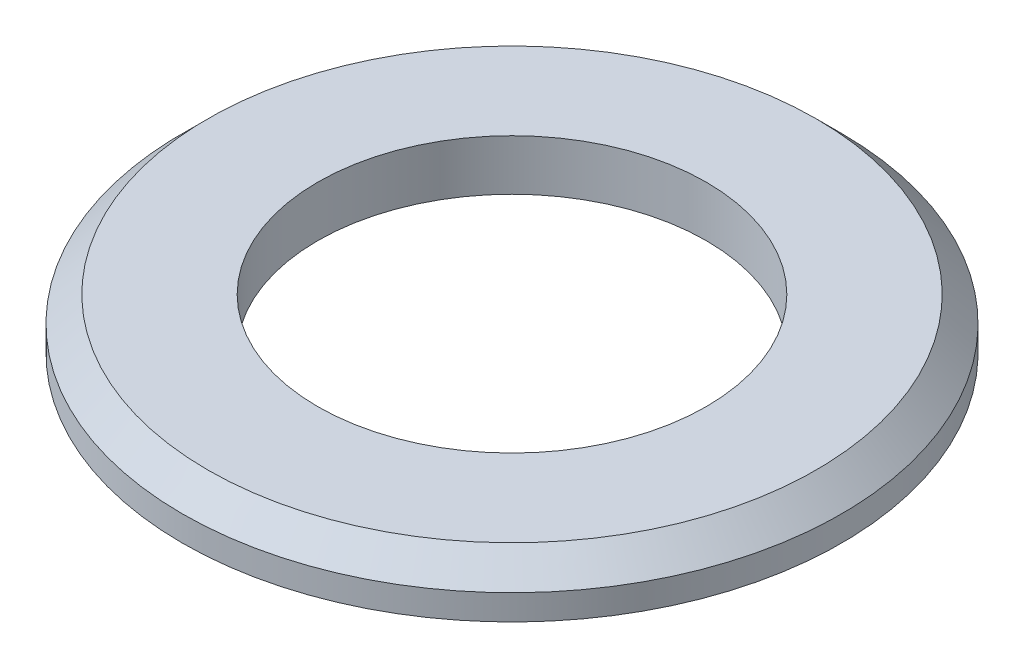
ISO-10303-21;
HEADER;
FILE_DESCRIPTION(('STEP AP214'),'2;1');
FILE_NAME('part.step','',(''),(''),'','','');
FILE_SCHEMA(('AUTOMOTIVE_DESIGN { 1 0 10303 214 1 1 1 1 }'));
ENDSEC;
DATA;
#1=APPLICATION_CONTEXT('core data for automotive mechanical design processes');
#2=APPLICATION_PROTOCOL_DEFINITION('international standard','automotive_design',2000,#1);
#3=PRODUCT_CONTEXT('',#1,'mechanical');
#4=PRODUCT('Part','Part','',(#3));
#5=PRODUCT_RELATED_PRODUCT_CATEGORY('part','',(#4));
#6=PRODUCT_DEFINITION_FORMATION('','',#4);
#7=PRODUCT_DEFINITION_CONTEXT('part definition',#1,'design');
#8=PRODUCT_DEFINITION('design','',#6,#7);
#9=PRODUCT_DEFINITION_SHAPE('','',#8);
#10=(LENGTH_UNIT() NAMED_UNIT(*) SI_UNIT(.MILLI.,.METRE.));
#11=(NAMED_UNIT(*) PLANE_ANGLE_UNIT() SI_UNIT($,.RADIAN.));
#12=(NAMED_UNIT(*) SI_UNIT($,.STERADIAN.) SOLID_ANGLE_UNIT());
#13=UNCERTAINTY_MEASURE_WITH_UNIT(LENGTH_MEASURE(1.E-05),#10,'distance_accuracy_value','');
#14=(GEOMETRIC_REPRESENTATION_CONTEXT(3) GLOBAL_UNCERTAINTY_ASSIGNED_CONTEXT((#13)) GLOBAL_UNIT_ASSIGNED_CONTEXT((#10,
#11,#12)) REPRESENTATION_CONTEXT('',''));
#15=CARTESIAN_POINT('',(0.,0.,0.));
#16=DIRECTION('',(0.,0.,1.));
#17=DIRECTION('',(1.,0.,0.));
#18=AXIS2_PLACEMENT_3D('',#15,#16,#17);
#19=CARTESIAN_POINT('',(0.,3.,0.));
#20=DIRECTION('',(0.,1.,0.));
#21=DIRECTION('',(0.,0.,1.));
#22=AXIS2_PLACEMENT_3D('',#19,#20,#21);
#23=PLANE('',#22);
#24=CARTESIAN_POINT('',(0.,3.,0.));
#25=DIRECTION('',(0.,1.,0.));
#26=DIRECTION('',(0.,0.,1.));
#27=AXIS2_PLACEMENT_3D('',#24,#25,#26);
#28=CIRCLE('',#27,18.);
#29=CARTESIAN_POINT('',(0.,3.,18.));
#30=VERTEX_POINT('',#29);
#31=EDGE_CURVE('E35',#30,#30,#28,.T.);
#32=ORIENTED_EDGE('',*,*,#31,.T.);
#33=EDGE_LOOP('',(#32));
#34=FACE_BOUND('',#33,.T.);
#35=CARTESIAN_POINT('',(0.,3.,0.));
#36=DIRECTION('',(0.,1.,0.));
#37=DIRECTION('',(0.,0.,1.));
#38=AXIS2_PLACEMENT_3D('',#35,#36,#37);
#39=CIRCLE('',#38,11.5);
#40=CARTESIAN_POINT('',(0.,3.,11.5));
#41=VERTEX_POINT('',#40);
#42=EDGE_CURVE('E43',#41,#41,#39,.T.);
#43=ORIENTED_EDGE('',*,*,#42,.F.);
#44=EDGE_LOOP('',(#43));
#45=FACE_BOUND('',#44,.T.);
#46=ADVANCED_FACE('F28',(#34,#45),#23,.T.);
#47=CARTESIAN_POINT('',(0.,0.,0.));
#48=DIRECTION('',(0.,1.,0.));
#49=DIRECTION('',(0.,0.,1.));
#50=AXIS2_PLACEMENT_3D('',#47,#48,#49);
#51=PLANE('',#50);
#52=CARTESIAN_POINT('',(0.,0.,0.));
#53=DIRECTION('',(0.,1.,0.));
#54=DIRECTION('',(0.,0.,1.));
#55=AXIS2_PLACEMENT_3D('',#52,#53,#54);
#56=CIRCLE('',#55,19.5);
#57=CARTESIAN_POINT('',(0.,0.,19.5));
#58=VERTEX_POINT('',#57);
#59=EDGE_CURVE('E39',#58,#58,#56,.T.);
#60=ORIENTED_EDGE('',*,*,#59,.F.);
#61=EDGE_LOOP('',(#60));
#62=FACE_BOUND('',#61,.T.);
#63=CARTESIAN_POINT('',(0.,0.,0.));
#64=DIRECTION('',(0.,1.,0.));
#65=DIRECTION('',(0.,0.,1.));
#66=AXIS2_PLACEMENT_3D('',#63,#64,#65);
#67=CIRCLE('',#66,11.5);
#68=CARTESIAN_POINT('',(0.,0.,11.5));
#69=VERTEX_POINT('',#68);
#70=EDGE_CURVE('E48',#69,#69,#67,.T.);
#71=ORIENTED_EDGE('',*,*,#70,.T.);
#72=EDGE_LOOP('',(#71));
#73=FACE_BOUND('',#72,.T.);
#74=ADVANCED_FACE('F52',(#62,#73),#51,.F.);
#75=CARTESIAN_POINT('',(0.,3.,0.));
#76=DIRECTION('',(0.,-1.,0.));
#77=DIRECTION('',(0.,0.,-1.));
#78=AXIS2_PLACEMENT_3D('',#75,#76,#77);
#79=CYLINDRICAL_SURFACE('',#78,19.5);
#80=CARTESIAN_POINT('',(0.,1.49999999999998,0.));
#81=DIRECTION('',(0.,1.,0.));
#82=DIRECTION('',(0.,0.,1.));
#83=AXIS2_PLACEMENT_3D('',#80,#81,#82);
#84=CIRCLE('',#83,19.5);
#85=CARTESIAN_POINT('',(0.,1.49999999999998,19.5));
#86=VERTEX_POINT('',#85);
#87=EDGE_CURVE('E10',#86,#86,#84,.F.);
#88=ORIENTED_EDGE('',*,*,#87,.T.);
#89=EDGE_LOOP('',(#88));
#90=FACE_BOUND('',#89,.T.);
#91=ORIENTED_EDGE('',*,*,#59,.T.);
#92=EDGE_LOOP('',(#91));
#93=FACE_BOUND('',#92,.T.);
#94=ADVANCED_FACE('F30',(#90,#93),#79,.T.);
#95=CARTESIAN_POINT('',(0.,3.,0.));
#96=DIRECTION('',(0.,-1.,0.));
#97=DIRECTION('',(0.,0.,-1.));
#98=AXIS2_PLACEMENT_3D('',#95,#96,#97);
#99=CYLINDRICAL_SURFACE('',#98,11.5);
#100=ORIENTED_EDGE('',*,*,#42,.T.);
#101=EDGE_LOOP('',(#100));
#102=FACE_BOUND('',#101,.T.);
#103=ORIENTED_EDGE('',*,*,#70,.F.);
#104=EDGE_LOOP('',(#103));
#105=FACE_BOUND('',#104,.T.);
#106=ADVANCED_FACE('F54',(#102,#105),#99,.F.);
#107=CARTESIAN_POINT('',(0.,3.,0.));
#108=DIRECTION('',(0.,-1.,0.));
#109=DIRECTION('',(0.,0.,-1.));
#110=AXIS2_PLACEMENT_3D('',#107,#108,#109);
#111=CONICAL_SURFACE('',#110,18.,0.785398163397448);
#112=ORIENTED_EDGE('',*,*,#87,.F.);
#113=EDGE_LOOP('',(#112));
#114=FACE_BOUND('',#113,.T.);
#115=ORIENTED_EDGE('',*,*,#31,.F.);
#116=EDGE_LOOP('',(#115));
#117=FACE_BOUND('',#116,.T.);
#118=ADVANCED_FACE('F56',(#114,#117),#111,.T.);
#119=CLOSED_SHELL('',(#46,#74,#94,#106,#118));
#120=MANIFOLD_SOLID_BREP('B2',#119);
#121=ADVANCED_BREP_SHAPE_REPRESENTATION('',(#18,#120),#14);
#122=SHAPE_DEFINITION_REPRESENTATION(#9,#121);
ENDSEC;
END-ISO-10303-21;
